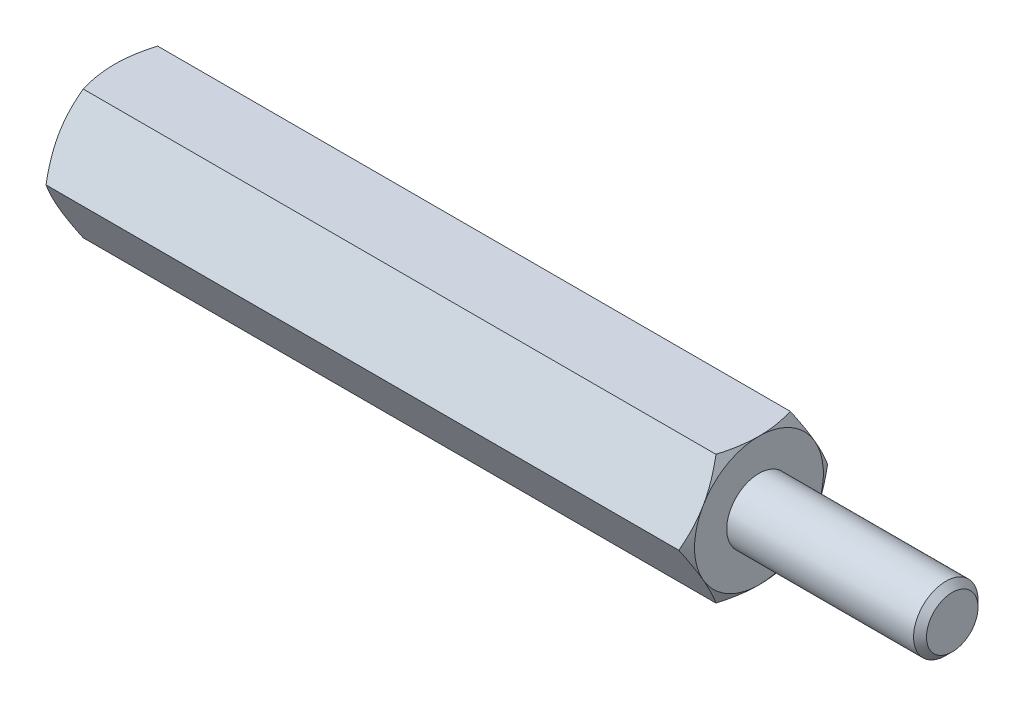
ISO-10303-21;
HEADER;
FILE_DESCRIPTION(('STEP AP214'),'2;1');
FILE_NAME('part.step','',(''),(''),'','','');
FILE_SCHEMA(('AUTOMOTIVE_DESIGN { 1 0 10303 214 1 1 1 1 }'));
ENDSEC;
DATA;
#1=APPLICATION_CONTEXT('core data for automotive mechanical design processes');
#2=APPLICATION_PROTOCOL_DEFINITION('international standard','automotive_design',2000,#1);
#3=PRODUCT_CONTEXT('',#1,'mechanical');
#4=PRODUCT('Part','Part','',(#3));
#5=PRODUCT_RELATED_PRODUCT_CATEGORY('part','',(#4));
#6=PRODUCT_DEFINITION_FORMATION('','',#4);
#7=PRODUCT_DEFINITION_CONTEXT('part definition',#1,'design');
#8=PRODUCT_DEFINITION('design','',#6,#7);
#9=PRODUCT_DEFINITION_SHAPE('','',#8);
#10=(LENGTH_UNIT() NAMED_UNIT(*) SI_UNIT(.MILLI.,.METRE.));
#11=(NAMED_UNIT(*) PLANE_ANGLE_UNIT() SI_UNIT($,.RADIAN.));
#12=(NAMED_UNIT(*) SI_UNIT($,.STERADIAN.) SOLID_ANGLE_UNIT());
#13=UNCERTAINTY_MEASURE_WITH_UNIT(LENGTH_MEASURE(1.E-05),#10,'distance_accuracy_value','');
#14=(GEOMETRIC_REPRESENTATION_CONTEXT(3) GLOBAL_UNCERTAINTY_ASSIGNED_CONTEXT((#13)) GLOBAL_UNIT_ASSIGNED_CONTEXT((#10,
#11,#12)) REPRESENTATION_CONTEXT('',''));
#15=CARTESIAN_POINT('',(0.,0.,0.));
#16=DIRECTION('',(0.,0.,1.));
#17=DIRECTION('',(1.,0.,0.));
#18=AXIS2_PLACEMENT_3D('',#15,#16,#17);
#19=CARTESIAN_POINT('',(10.,2.,-1.15470053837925));
#20=DIRECTION('',(1.,0.,0.));
#21=DIRECTION('',(0.,0.,-1.));
#22=AXIS2_PLACEMENT_3D('',#19,#20,#21);
#23=PLANE('',#22);
#24=CARTESIAN_POINT('',(10.,0.,0.));
#25=DIRECTION('',(1.,0.,0.));
#26=DIRECTION('',(0.,0.,-1.));
#27=AXIS2_PLACEMENT_3D('',#24,#25,#26);
#28=CIRCLE('',#27,2.);
#29=CARTESIAN_POINT('',(10.,-1.,-1.73205080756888));
#30=VERTEX_POINT('',#29);
#31=CARTESIAN_POINT('',(10.,0.999999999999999,-1.73205080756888));
#32=VERTEX_POINT('',#31);
#33=EDGE_CURVE('E288',#30,#32,#28,.T.);
#34=ORIENTED_EDGE('',*,*,#33,.T.);
#35=CARTESIAN_POINT('',(10.,2.,0.));
#36=VERTEX_POINT('',#35);
#37=EDGE_CURVE('E53',#32,#36,#28,.T.);
#38=ORIENTED_EDGE('',*,*,#37,.T.);
#39=CARTESIAN_POINT('',(10.,0.999999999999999,1.73205080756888));
#40=VERTEX_POINT('',#39);
#41=EDGE_CURVE('E295',#36,#40,#28,.T.);
#42=ORIENTED_EDGE('',*,*,#41,.T.);
#43=CARTESIAN_POINT('',(10.,-1.,1.73205080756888));
#44=VERTEX_POINT('',#43);
#45=EDGE_CURVE('E300',#40,#44,#28,.T.);
#46=ORIENTED_EDGE('',*,*,#45,.T.);
#47=CARTESIAN_POINT('',(10.,0.,0.));
#48=DIRECTION('',(-1.,0.,0.));
#49=DIRECTION('',(0.,-1.,0.));
#50=AXIS2_PLACEMENT_3D('',#47,#48,#49);
#51=CIRCLE('',#50,2.);
#52=CARTESIAN_POINT('',(10.,-2.,0.));
#53=VERTEX_POINT('',#52);
#54=EDGE_CURVE('E193',#53,#44,#51,.T.);
#55=ORIENTED_EDGE('',*,*,#54,.F.);
#56=EDGE_CURVE('E61',#53,#30,#28,.T.);
#57=ORIENTED_EDGE('',*,*,#56,.T.);
#58=EDGE_LOOP('',(#34,#38,#42,#46,#55,#57));
#59=FACE_BOUND('',#58,.T.);
#60=CARTESIAN_POINT('',(10.,0.,0.));
#61=DIRECTION('',(1.,0.,0.));
#62=DIRECTION('',(0.,0.,-1.));
#63=AXIS2_PLACEMENT_3D('',#60,#61,#62);
#64=CIRCLE('',#63,1.);
#65=CARTESIAN_POINT('',(10.,0.,-1.));
#66=VERTEX_POINT('',#65);
#67=EDGE_CURVE('E324',#66,#66,#64,.T.);
#68=ORIENTED_EDGE('',*,*,#67,.F.);
#69=EDGE_LOOP('',(#68));
#70=FACE_BOUND('',#69,.T.);
#71=ADVANCED_FACE('F37',(#59,#70),#23,.T.);
#72=CARTESIAN_POINT('',(10.,0.,-2.3094010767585));
#73=DIRECTION('',(0.,-0.5,0.866025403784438));
#74=DIRECTION('',(0.,-0.866025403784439,-0.5));
#75=AXIS2_PLACEMENT_3D('',#72,#73,#74);
#76=PLANE('',#75);
#77=CARTESIAN_POINT('',(9.8213005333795,-0.000200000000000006,-2.30951654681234));
#78=CARTESIAN_POINT('',(9.85061046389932,0.0876912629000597,-2.25877250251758));
#79=CARTESIAN_POINT('',(9.87726714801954,0.176341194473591,-2.20759044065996));
#80=CARTESIAN_POINT('',(9.92379750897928,0.355176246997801,-2.10433997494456));
#81=CARTESIAN_POINT('',(9.94365472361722,0.445364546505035,-2.05226973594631));
#82=CARTESIAN_POINT('',(9.97456653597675,0.624623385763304,-1.94877459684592));
#83=CARTESIAN_POINT('',(9.98582684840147,0.713666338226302,-1.89736562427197));
#84=CARTESIAN_POINT('',(9.99927133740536,0.892171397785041,-1.79430568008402));
#85=CARTESIAN_POINT('',(10.0014666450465,0.981632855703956,-1.74265508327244));
#86=CARTESIAN_POINT('',(9.99690901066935,1.1488083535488,-1.64613626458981));
#87=CARTESIAN_POINT('',(9.99127512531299,1.22654737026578,-1.60125362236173));
#88=CARTESIAN_POINT('',(9.97341610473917,1.38151891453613,-1.51178075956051));
#89=CARTESIAN_POINT('',(9.96118486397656,1.4587509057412,-1.46719084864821));
#90=CARTESIAN_POINT('',(9.93060656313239,1.6140421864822,-1.37753338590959));
#91=CARTESIAN_POINT('',(9.91212983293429,1.69208181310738,-1.33247718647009));
#92=CARTESIAN_POINT('',(9.87019448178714,1.84699686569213,-1.24303693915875));
#93=CARTESIAN_POINT('',(9.84674571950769,1.92387427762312,-1.1986517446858));
#94=CARTESIAN_POINT('',(9.8213005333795,2.0002,-1.15458506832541));
#95=B_SPLINE_CURVE_WITH_KNOTS('',3,(#77,#78,#79,#80,#81,#82,#83,#84,#85,#86,#87,#88,#89,#90,#91,
#92,#93,#94),.UNSPECIFIED.,.F.,.F.,(4,2,2,2,2,2,2,2,4),(0.,0.317031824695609,0.634825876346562,
0.944753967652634,1.25430138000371,1.52387047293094,1.79368946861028,2.06949491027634,
2.34475850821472),.UNSPECIFIED.);
#96=CARTESIAN_POINT('',(9.82136720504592,0.,-2.3094010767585));
#97=VERTEX_POINT('',#96);
#98=EDGE_CURVE('E311',#97,#32,#95,.T.);
#99=ORIENTED_EDGE('',*,*,#98,.F.);
#100=DIRECTION('',(-1.,0.,0.));
#101=VECTOR('',#100,1.);
#102=CARTESIAN_POINT('',(10.,0.,-2.3094010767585));
#103=LINE('',#102,#101);
#104=CARTESIAN_POINT('',(-9.82136720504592,0.,-2.3094010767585));
#105=VERTEX_POINT('',#104);
#106=EDGE_CURVE('E264',#97,#105,#103,.T.);
#107=ORIENTED_EDGE('',*,*,#106,.T.);
#108=CARTESIAN_POINT('',(-9.8213005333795,2.0002,-1.15458506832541));
#109=CARTESIAN_POINT('',(-9.85061046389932,1.91230873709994,-1.20532911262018));
#110=CARTESIAN_POINT('',(-9.87726714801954,1.82365880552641,-1.2565111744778));
#111=CARTESIAN_POINT('',(-9.92379750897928,1.6448237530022,-1.35976164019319));
#112=CARTESIAN_POINT('',(-9.94365472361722,1.55463545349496,-1.41183187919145));
#113=CARTESIAN_POINT('',(-9.97456653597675,1.37537661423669,-1.51532701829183));
#114=CARTESIAN_POINT('',(-9.98582684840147,1.2863336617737,-1.56673599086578));
#115=CARTESIAN_POINT('',(-9.99927133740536,1.10782860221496,-1.66979593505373));
#116=CARTESIAN_POINT('',(-10.0014666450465,1.01836714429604,-1.72144653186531));
#117=CARTESIAN_POINT('',(-9.99690901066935,0.851191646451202,-1.81796535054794));
#118=CARTESIAN_POINT('',(-9.99127512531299,0.773452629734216,-1.86284799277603));
#119=CARTESIAN_POINT('',(-9.97341610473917,0.618481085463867,-1.95232085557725));
#120=CARTESIAN_POINT('',(-9.96118486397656,0.541249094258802,-1.99691076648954));
#121=CARTESIAN_POINT('',(-9.93060656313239,0.385957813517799,-2.08656822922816));
#122=CARTESIAN_POINT('',(-9.91212983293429,0.307918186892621,-2.13162442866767));
#123=CARTESIAN_POINT('',(-9.87019448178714,0.153003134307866,-2.221064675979));
#124=CARTESIAN_POINT('',(-9.84674571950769,0.0761257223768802,-2.26544987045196));
#125=CARTESIAN_POINT('',(-9.8213005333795,-0.000200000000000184,-2.30951654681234));
#126=B_SPLINE_CURVE_WITH_KNOTS('',3,(#108,#109,#110,#111,#112,#113,#114,#115,#116,#117,#118,
#119,#120,#121,#122,#123,#124,#125),.UNSPECIFIED.,.F.,.F.,(4,2,2,2,2,2,2,2,4),(0.,
0.317031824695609,0.634825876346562,0.944753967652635,1.25430138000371,1.52387047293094,
1.79368946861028,2.06949491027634,2.34475850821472),.UNSPECIFIED.);
#127=CARTESIAN_POINT('',(-10.,0.999999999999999,-1.73205080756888));
#128=VERTEX_POINT('',#127);
#129=EDGE_CURVE('E340',#128,#105,#126,.T.);
#130=ORIENTED_EDGE('',*,*,#129,.F.);
#131=CARTESIAN_POINT('',(-9.82136720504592,2.,-1.15470053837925));
#132=VERTEX_POINT('',#131);
#133=EDGE_CURVE('E343',#132,#128,#126,.T.);
#134=ORIENTED_EDGE('',*,*,#133,.F.);
#135=DIRECTION('',(-1.,0.,0.));
#136=VECTOR('',#135,1.);
#137=CARTESIAN_POINT('',(10.,2.,-1.15470053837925));
#138=LINE('',#137,#136);
#139=CARTESIAN_POINT('',(9.821367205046,2.,-1.15470053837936));
#140=VERTEX_POINT('',#139);
#141=EDGE_CURVE('E279',#140,#132,#138,.T.);
#142=ORIENTED_EDGE('',*,*,#141,.F.);
#143=EDGE_CURVE('E229',#32,#140,#95,.T.);
#144=ORIENTED_EDGE('',*,*,#143,.F.);
#145=EDGE_LOOP('',(#99,#107,#130,#134,#142,#144));
#146=FACE_BOUND('',#145,.T.);
#147=ADVANCED_FACE('F148',(#146),#76,.F.);
#148=CARTESIAN_POINT('',(10.,2.,-1.15470053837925));
#149=DIRECTION('',(0.,-1.,0.));
#150=DIRECTION('',(0.,0.,-1.));
#151=AXIS2_PLACEMENT_3D('',#148,#149,#150);
#152=PLANE('',#151);
#153=CARTESIAN_POINT('',(9.0041453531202,2.,-3.14239762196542));
#154=CARTESIAN_POINT('',(9.04685680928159,2.,-3.05468337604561));
#155=CARTESIAN_POINT('',(9.08917030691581,2.,-2.96677207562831));
#156=CARTESIAN_POINT('',(9.17277831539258,2.,-2.79045070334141));
#157=CARTESIAN_POINT('',(9.21407267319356,2.,-2.70204055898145));
#158=CARTESIAN_POINT('',(9.29561838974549,2.,-2.52418069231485));
#159=CARTESIAN_POINT('',(9.33586319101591,2.,-2.43472795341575));
#160=CARTESIAN_POINT('',(9.41475904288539,2.,-2.25512498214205));
#161=CARTESIAN_POINT('',(9.45341016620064,2.,-2.16497478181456));
#162=CARTESIAN_POINT('',(9.52996617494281,2.,-1.98078525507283));
#163=CARTESIAN_POINT('',(9.56780217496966,2.,-1.88671714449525));
#164=CARTESIAN_POINT('',(9.64070044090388,2.,-1.69751412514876));
#165=CARTESIAN_POINT('',(9.67576294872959,2.,-1.60237931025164));
#166=CARTESIAN_POINT('',(9.74223535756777,2.,-1.41102905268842));
#167=CARTESIAN_POINT('',(9.77365196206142,2.,-1.31481596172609));
#168=CARTESIAN_POINT('',(9.83184764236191,2.,-1.12101028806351));
#169=CARTESIAN_POINT('',(9.8586281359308,2.,-1.02341813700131));
#170=CARTESIAN_POINT('',(9.90615162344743,2.,-0.827336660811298));
#171=CARTESIAN_POINT('',(9.9269281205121,2.,-0.728855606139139));
#172=CARTESIAN_POINT('',(9.96129559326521,2.,-0.530628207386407));
#173=CARTESIAN_POINT('',(9.97488733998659,2.,-0.430882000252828));
#174=CARTESIAN_POINT('',(9.99362159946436,2.,-0.231937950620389));
#175=CARTESIAN_POINT('',(9.99887592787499,2.,-0.132750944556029));
#176=CARTESIAN_POINT('',(10.0007996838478,2.,0.0657049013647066));
#177=CARTESIAN_POINT('',(9.9974689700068,2.,0.164973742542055));
#178=CARTESIAN_POINT('',(9.97965125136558,2.,0.400692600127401));
#179=CARTESIAN_POINT('',(9.96138848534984,2.,0.536859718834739));
#180=CARTESIAN_POINT('',(9.91179958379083,2.,0.806792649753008));
#181=CARTESIAN_POINT('',(9.88046153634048,2.,0.9405561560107));
#182=CARTESIAN_POINT('',(9.80733694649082,2.,1.20849227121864));
#183=CARTESIAN_POINT('',(9.76532316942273,2.,1.34260127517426));
#184=CARTESIAN_POINT('',(9.69701155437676,2.,1.54188460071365));
#185=CARTESIAN_POINT('',(9.67336125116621,2.,1.6079939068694));
#186=CARTESIAN_POINT('',(9.62457310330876,2.,1.73966131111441));
#187=CARTESIAN_POINT('',(9.59943529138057,2.,1.80521942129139));
#188=CARTESIAN_POINT('',(9.53045244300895,2.,1.98014362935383));
#189=CARTESIAN_POINT('',(9.48548288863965,2.,2.08906517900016));
#190=CARTESIAN_POINT('',(9.39293953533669,2.,2.3058004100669));
#191=CARTESIAN_POINT('',(9.34536546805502,2.,2.41361397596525));
#192=CARTESIAN_POINT('',(9.24822629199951,2.,2.62838132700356));
#193=CARTESIAN_POINT('',(9.19866051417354,2.,2.7353348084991));
#194=CARTESIAN_POINT('',(9.09800140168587,2.,2.94852186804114));
#195=CARTESIAN_POINT('',(9.04690802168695,2.,3.05475542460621));
#196=CARTESIAN_POINT('',(8.89169615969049,2.,3.37291303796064));
#197=CARTESIAN_POINT('',(8.78579652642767,2.,3.58396705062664));
#198=CARTESIAN_POINT('',(8.57100981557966,2.,4.00448363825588));
#199=CARTESIAN_POINT('',(8.46212334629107,2.,4.21394652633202));
#200=CARTESIAN_POINT('',(8.25376773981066,2.,4.61000648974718));
#201=CARTESIAN_POINT('',(8.15450073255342,2.,4.79671008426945));
#202=CARTESIAN_POINT('',(7.95476413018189,2.,5.16948614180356));
#203=CARTESIAN_POINT('',(7.85429446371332,2.,5.35555856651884));
#204=CARTESIAN_POINT('',(7.6527937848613,2.,5.72660635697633));
#205=CARTESIAN_POINT('',(7.55176570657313,2.,5.91158331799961));
#206=CARTESIAN_POINT('',(7.34902395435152,2.,6.28114276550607));
#207=CARTESIAN_POINT('',(7.24731033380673,2.,6.46572528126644));
#208=CARTESIAN_POINT('',(7.14534707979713,2.,6.65016883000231));
#209=B_SPLINE_CURVE_WITH_KNOTS('',3,(#153,#154,#155,#156,#157,#158,#159,#160,#161,#162,#163,
#164,#165,#166,#167,#168,#169,#170,#171,#172,#173,#174,#175,#176,#177,#178,#179,#180,#181,#182,
#183,#184,#185,#186,#187,#188,#189,#190,#191,#192,#193,#194,#195,#196,#197,#198,#199,#200,#201,
#202,#203,#204,#205,#206,#207,#208),.UNSPECIFIED.,.F.,.F.,(4,2,2,2,2,2,2,2,2,2,2,2,2,2,2,2,2,2,
2,2,2,2,2,2,2,2,2,4),(0.,0.29268498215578,0.585413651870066,0.879667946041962,1.17390879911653,
1.47805164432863,1.78216793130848,2.08571589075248,2.38917085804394,2.690898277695,
2.99259331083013,3.29020694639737,3.58782548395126,3.99913738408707,4.41082482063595,
4.83214112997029,5.0427662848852,5.25338680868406,5.6068563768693,5.96036243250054,
6.31398824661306,6.66762456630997,7.37597688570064,8.08418599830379,8.71853756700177,
9.3529269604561,9.98522933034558,10.6174830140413),.UNSPECIFIED.);
#210=EDGE_CURVE('E227',#140,#36,#209,.T.);
#211=ORIENTED_EDGE('',*,*,#210,.F.);
#212=ORIENTED_EDGE('',*,*,#141,.T.);
#213=CARTESIAN_POINT('',(-9.0041453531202,2.,-3.14239762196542));
#214=CARTESIAN_POINT('',(-9.0468568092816,2.,-3.05468337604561));
#215=CARTESIAN_POINT('',(-9.08917030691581,2.,-2.96677207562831));
#216=CARTESIAN_POINT('',(-9.17277831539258,2.,-2.79045070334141));
#217=CARTESIAN_POINT('',(-9.21407267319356,2.,-2.70204055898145));
#218=CARTESIAN_POINT('',(-9.29561838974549,2.,-2.52418069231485));
#219=CARTESIAN_POINT('',(-9.33586319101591,2.,-2.43472795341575));
#220=CARTESIAN_POINT('',(-9.41475904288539,2.,-2.25512498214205));
#221=CARTESIAN_POINT('',(-9.45341016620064,2.,-2.16497478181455));
#222=CARTESIAN_POINT('',(-9.52996617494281,2.,-1.98078525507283));
#223=CARTESIAN_POINT('',(-9.56780217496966,2.,-1.88671714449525));
#224=CARTESIAN_POINT('',(-9.64070044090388,2.,-1.69751412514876));
#225=CARTESIAN_POINT('',(-9.67576294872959,2.,-1.60237931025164));
#226=CARTESIAN_POINT('',(-9.74223535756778,2.,-1.41102905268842));
#227=CARTESIAN_POINT('',(-9.77365196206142,2.,-1.31481596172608));
#228=CARTESIAN_POINT('',(-9.83184764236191,2.,-1.12101028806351));
#229=CARTESIAN_POINT('',(-9.8586281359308,2.,-1.02341813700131));
#230=CARTESIAN_POINT('',(-9.90615162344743,2.,-0.827336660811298));
#231=CARTESIAN_POINT('',(-9.9269281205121,2.,-0.728855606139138));
#232=CARTESIAN_POINT('',(-9.96129559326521,2.,-0.530628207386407));
#233=CARTESIAN_POINT('',(-9.97488733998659,2.,-0.430882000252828));
#234=CARTESIAN_POINT('',(-9.99362159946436,2.,-0.231937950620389));
#235=CARTESIAN_POINT('',(-9.99887592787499,2.,-0.132750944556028));
#236=CARTESIAN_POINT('',(-10.0007996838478,2.,0.065704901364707));
#237=CARTESIAN_POINT('',(-9.9974689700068,2.,0.164973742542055));
#238=CARTESIAN_POINT('',(-9.97965125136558,2.,0.400692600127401));
#239=CARTESIAN_POINT('',(-9.96138848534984,2.,0.536859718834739));
#240=CARTESIAN_POINT('',(-9.91179958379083,2.,0.806792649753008));
#241=CARTESIAN_POINT('',(-9.88046153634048,2.,0.9405561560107));
#242=CARTESIAN_POINT('',(-9.80733694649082,2.,1.20849227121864));
#243=CARTESIAN_POINT('',(-9.76532316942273,2.,1.34260127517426));
#244=CARTESIAN_POINT('',(-9.69701155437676,2.,1.54188460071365));
#245=CARTESIAN_POINT('',(-9.67336125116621,2.,1.60799390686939));
#246=CARTESIAN_POINT('',(-9.62457310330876,2.,1.73966131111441));
#247=CARTESIAN_POINT('',(-9.59943529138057,2.,1.80521942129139));
#248=CARTESIAN_POINT('',(-9.53045244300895,2.,1.98014362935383));
#249=CARTESIAN_POINT('',(-9.48548288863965,2.,2.08906517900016));
#250=CARTESIAN_POINT('',(-9.39293953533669,2.,2.3058004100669));
#251=CARTESIAN_POINT('',(-9.34536546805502,2.,2.41361397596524));
#252=CARTESIAN_POINT('',(-9.24822629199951,2.,2.62838132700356));
#253=CARTESIAN_POINT('',(-9.19866051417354,2.,2.7353348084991));
#254=CARTESIAN_POINT('',(-9.09800140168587,2.,2.94852186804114));
#255=CARTESIAN_POINT('',(-9.04690802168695,2.,3.05475542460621));
#256=CARTESIAN_POINT('',(-8.89169615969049,2.,3.37291303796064));
#257=CARTESIAN_POINT('',(-8.78579652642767,2.,3.58396705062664));
#258=CARTESIAN_POINT('',(-8.57100981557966,2.,4.00448363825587));
#259=CARTESIAN_POINT('',(-8.46212334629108,2.,4.21394652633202));
#260=CARTESIAN_POINT('',(-8.25376773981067,2.,4.61000648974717));
#261=CARTESIAN_POINT('',(-8.15450073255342,2.,4.79671008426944));
#262=CARTESIAN_POINT('',(-7.9547641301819,2.,5.16948614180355));
#263=CARTESIAN_POINT('',(-7.85429446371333,2.,5.35555856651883));
#264=CARTESIAN_POINT('',(-7.6527937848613,2.,5.72660635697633));
#265=CARTESIAN_POINT('',(-7.55176570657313,2.,5.9115833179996));
#266=CARTESIAN_POINT('',(-7.34902395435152,2.,6.28114276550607));
#267=CARTESIAN_POINT('',(-7.24731033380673,2.,6.46572528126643));
#268=CARTESIAN_POINT('',(-7.14534707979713,2.,6.65016883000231));
#269=B_SPLINE_CURVE_WITH_KNOTS('',3,(#213,#214,#215,#216,#217,#218,#219,#220,#221,#222,#223,
#224,#225,#226,#227,#228,#229,#230,#231,#232,#233,#234,#235,#236,#237,#238,#239,#240,#241,#242,
#243,#244,#245,#246,#247,#248,#249,#250,#251,#252,#253,#254,#255,#256,#257,#258,#259,#260,#261,
#262,#263,#264,#265,#266,#267,#268),.UNSPECIFIED.,.F.,.F.,(4,2,2,2,2,2,2,2,2,2,2,2,2,2,2,2,2,2,
2,2,2,2,2,2,2,2,2,4),(0.,0.292684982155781,0.585413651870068,0.879667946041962,1.17390879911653,
1.47805164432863,1.78216793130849,2.08571589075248,2.38917085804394,2.690898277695,
2.99259331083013,3.29020694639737,3.58782548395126,3.99913738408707,4.41082482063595,
4.83214112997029,5.0427662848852,5.25338680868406,5.60685637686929,5.96036243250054,
6.31398824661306,6.66762456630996,7.37597688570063,8.08418599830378,8.71853756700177,
9.35292696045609,9.98522933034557,10.6174830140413),.UNSPECIFIED.);
#270=CARTESIAN_POINT('',(-10.,2.,0.));
#271=VERTEX_POINT('',#270);
#272=EDGE_CURVE('E241',#271,#132,#269,.F.);
#273=ORIENTED_EDGE('',*,*,#272,.F.);
#274=CARTESIAN_POINT('',(-9.82136720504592,2.,1.15470053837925));
#275=VERTEX_POINT('',#274);
#276=EDGE_CURVE('E249',#275,#271,#269,.F.);
#277=ORIENTED_EDGE('',*,*,#276,.F.);
#278=DIRECTION('',(-1.,0.,0.));
#279=VECTOR('',#278,1.);
#280=CARTESIAN_POINT('',(10.,2.,1.15470053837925));
#281=LINE('',#280,#279);
#282=CARTESIAN_POINT('',(9.82136720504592,2.,1.15470053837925));
#283=VERTEX_POINT('',#282);
#284=EDGE_CURVE('E276',#283,#275,#281,.T.);
#285=ORIENTED_EDGE('',*,*,#284,.F.);
#286=EDGE_CURVE('E221',#36,#283,#209,.T.);
#287=ORIENTED_EDGE('',*,*,#286,.F.);
#288=EDGE_LOOP('',(#211,#212,#273,#277,#285,#287));
#289=FACE_BOUND('',#288,.T.);
#290=ADVANCED_FACE('F153',(#289),#152,.F.);
#291=CARTESIAN_POINT('',(10.,2.,1.15470053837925));
#292=DIRECTION('',(0.,-0.5,-0.866025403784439));
#293=DIRECTION('',(0.,0.866025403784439,-0.5));
#294=AXIS2_PLACEMENT_3D('',#291,#292,#293);
#295=PLANE('',#294);
#296=CARTESIAN_POINT('',(9.8213005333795,2.0002,1.15458506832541));
#297=CARTESIAN_POINT('',(9.85061046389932,1.91230873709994,1.20532911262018));
#298=CARTESIAN_POINT('',(9.87726714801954,1.82365880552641,1.2565111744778));
#299=CARTESIAN_POINT('',(9.92379750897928,1.6448237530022,1.35976164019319));
#300=CARTESIAN_POINT('',(9.94365472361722,1.55463545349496,1.41183187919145));
#301=CARTESIAN_POINT('',(9.97456653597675,1.37537661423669,1.51532701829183));
#302=CARTESIAN_POINT('',(9.98582684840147,1.2863336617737,1.56673599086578));
#303=CARTESIAN_POINT('',(9.99927133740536,1.10782860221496,1.66979593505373));
#304=CARTESIAN_POINT('',(10.0014666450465,1.01836714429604,1.72144653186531));
#305=CARTESIAN_POINT('',(9.99690901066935,0.851191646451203,1.81796535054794));
#306=CARTESIAN_POINT('',(9.99127512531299,0.773452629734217,1.86284799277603));
#307=CARTESIAN_POINT('',(9.97341610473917,0.618481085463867,1.95232085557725));
#308=CARTESIAN_POINT('',(9.96118486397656,0.541249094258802,1.99691076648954));
#309=CARTESIAN_POINT('',(9.93060656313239,0.385957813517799,2.08656822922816));
#310=CARTESIAN_POINT('',(9.91212983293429,0.307918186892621,2.13162442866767));
#311=CARTESIAN_POINT('',(9.87019448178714,0.153003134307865,2.221064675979));
#312=CARTESIAN_POINT('',(9.84674571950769,0.0761257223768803,2.26544987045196));
#313=CARTESIAN_POINT('',(9.8213005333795,-0.000199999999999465,2.30951654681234));
#314=B_SPLINE_CURVE_WITH_KNOTS('',3,(#296,#297,#298,#299,#300,#301,#302,#303,#304,#305,#306,
#307,#308,#309,#310,#311,#312,#313),.UNSPECIFIED.,.F.,.F.,(4,2,2,2,2,2,2,2,4),(0.,
0.317031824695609,0.634825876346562,0.944753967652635,1.25430138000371,1.52387047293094,
1.79368946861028,2.06949491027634,2.34475850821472),.UNSPECIFIED.);
#315=EDGE_CURVE('E228',#283,#40,#314,.T.);
#316=ORIENTED_EDGE('',*,*,#315,.F.);
#317=ORIENTED_EDGE('',*,*,#284,.T.);
#318=CARTESIAN_POINT('',(-9.8213005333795,-0.000199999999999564,2.30951654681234));
#319=CARTESIAN_POINT('',(-9.85061046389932,0.0876912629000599,2.25877250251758));
#320=CARTESIAN_POINT('',(-9.87726714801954,0.176341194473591,2.20759044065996));
#321=CARTESIAN_POINT('',(-9.92379750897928,0.355176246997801,2.10433997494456));
#322=CARTESIAN_POINT('',(-9.94365472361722,0.445364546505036,2.0522697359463));
#323=CARTESIAN_POINT('',(-9.97456653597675,0.624623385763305,1.94877459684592));
#324=CARTESIAN_POINT('',(-9.98582684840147,0.713666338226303,1.89736562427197));
#325=CARTESIAN_POINT('',(-9.99927133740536,0.892171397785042,1.79430568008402));
#326=CARTESIAN_POINT('',(-10.0014666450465,0.981632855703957,1.74265508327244));
#327=CARTESIAN_POINT('',(-9.99690901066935,1.1488083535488,1.64613626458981));
#328=CARTESIAN_POINT('',(-9.99127512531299,1.22654737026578,1.60125362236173));
#329=CARTESIAN_POINT('',(-9.97341610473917,1.38151891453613,1.51178075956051));
#330=CARTESIAN_POINT('',(-9.96118486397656,1.4587509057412,1.46719084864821));
#331=CARTESIAN_POINT('',(-9.93060656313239,1.6140421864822,1.37753338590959));
#332=CARTESIAN_POINT('',(-9.91212983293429,1.69208181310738,1.33247718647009));
#333=CARTESIAN_POINT('',(-9.87019448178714,1.84699686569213,1.24303693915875));
#334=CARTESIAN_POINT('',(-9.84674571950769,1.92387427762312,1.1986517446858));
#335=CARTESIAN_POINT('',(-9.8213005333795,2.0002,1.15458506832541));
#336=B_SPLINE_CURVE_WITH_KNOTS('',3,(#318,#319,#320,#321,#322,#323,#324,#325,#326,#327,#328,
#329,#330,#331,#332,#333,#334,#335),.UNSPECIFIED.,.F.,.F.,(4,2,2,2,2,2,2,2,4),(0.,
0.317031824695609,0.634825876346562,0.944753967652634,1.25430138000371,1.52387047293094,
1.79368946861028,2.06949491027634,2.34475850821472),.UNSPECIFIED.);
#337=CARTESIAN_POINT('',(-10.,0.999999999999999,1.73205080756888));
#338=VERTEX_POINT('',#337);
#339=EDGE_CURVE('E255',#338,#275,#336,.T.);
#340=ORIENTED_EDGE('',*,*,#339,.F.);
#341=CARTESIAN_POINT('',(-9.82136720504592,0.,2.3094010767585));
#342=VERTEX_POINT('',#341);
#343=EDGE_CURVE('E262',#342,#338,#336,.T.);
#344=ORIENTED_EDGE('',*,*,#343,.F.);
#345=DIRECTION('',(-1.,0.,0.));
#346=VECTOR('',#345,1.);
#347=CARTESIAN_POINT('',(10.,0.,2.3094010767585));
#348=LINE('',#347,#346);
#349=CARTESIAN_POINT('',(9.82136720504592,0.,2.3094010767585));
#350=VERTEX_POINT('',#349);
#351=EDGE_CURVE('E273',#350,#342,#348,.T.);
#352=ORIENTED_EDGE('',*,*,#351,.F.);
#353=EDGE_CURVE('E215',#40,#350,#314,.T.);
#354=ORIENTED_EDGE('',*,*,#353,.F.);
#355=EDGE_LOOP('',(#316,#317,#340,#344,#352,#354));
#356=FACE_BOUND('',#355,.T.);
#357=ADVANCED_FACE('F235',(#356),#295,.F.);
#358=CARTESIAN_POINT('',(10.,0.,2.3094010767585));
#359=DIRECTION('',(0.,0.5,-0.866025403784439));
#360=DIRECTION('',(0.,0.866025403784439,0.5));
#361=AXIS2_PLACEMENT_3D('',#358,#359,#360);
#362=PLANE('',#361);
#363=CARTESIAN_POINT('',(9.8213005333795,0.000200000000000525,2.30951654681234));
#364=CARTESIAN_POINT('',(9.85061046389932,-0.0876912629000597,2.25877250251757));
#365=CARTESIAN_POINT('',(9.87726714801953,-0.176341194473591,2.20759044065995));
#366=CARTESIAN_POINT('',(9.92379750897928,-0.355176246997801,2.10433997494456));
#367=CARTESIAN_POINT('',(9.94365472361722,-0.445364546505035,2.0522697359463));
#368=CARTESIAN_POINT('',(9.97456653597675,-0.624623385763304,1.94877459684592));
#369=CARTESIAN_POINT('',(9.98582684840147,-0.713666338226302,1.89736562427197));
#370=CARTESIAN_POINT('',(9.99927133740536,-0.892171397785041,1.79430568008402));
#371=CARTESIAN_POINT('',(10.0014666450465,-0.981632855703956,1.74265508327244));
#372=CARTESIAN_POINT('',(9.99690901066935,-1.1488083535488,1.64613626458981));
#373=CARTESIAN_POINT('',(9.99127512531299,-1.22654737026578,1.60125362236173));
#374=CARTESIAN_POINT('',(9.97341610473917,-1.38151891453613,1.51178075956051));
#375=CARTESIAN_POINT('',(9.96118486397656,-1.4587509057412,1.46719084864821));
#376=CARTESIAN_POINT('',(9.93060656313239,-1.6140421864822,1.37753338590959));
#377=CARTESIAN_POINT('',(9.91212983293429,-1.69208181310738,1.33247718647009));
#378=CARTESIAN_POINT('',(9.87019448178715,-1.84699686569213,1.24303693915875));
#379=CARTESIAN_POINT('',(9.84674571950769,-1.92387427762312,1.1986517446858));
#380=CARTESIAN_POINT('',(9.8213005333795,-2.0002,1.15458506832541));
#381=B_SPLINE_CURVE_WITH_KNOTS('',3,(#363,#364,#365,#366,#367,#368,#369,#370,#371,#372,#373,
#374,#375,#376,#377,#378,#379,#380),.UNSPECIFIED.,.F.,.F.,(4,2,2,2,2,2,2,2,4),(0.,
0.31703182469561,0.634825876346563,0.944753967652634,1.25430138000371,1.52387047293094,
1.79368946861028,2.06949491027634,2.34475850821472),.UNSPECIFIED.);
#382=EDGE_CURVE('E389',#350,#44,#381,.T.);
#383=ORIENTED_EDGE('',*,*,#382,.F.);
#384=ORIENTED_EDGE('',*,*,#351,.T.);
#385=CARTESIAN_POINT('',(-9.8213005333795,-2.0002,1.15458506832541));
#386=CARTESIAN_POINT('',(-9.85061046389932,-1.91230873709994,1.20532911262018));
#387=CARTESIAN_POINT('',(-9.87726714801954,-1.82365880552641,1.2565111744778));
#388=CARTESIAN_POINT('',(-9.92379750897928,-1.6448237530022,1.35976164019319));
#389=CARTESIAN_POINT('',(-9.94365472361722,-1.55463545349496,1.41183187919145));
#390=CARTESIAN_POINT('',(-9.97456653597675,-1.3753766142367,1.51532701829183));
#391=CARTESIAN_POINT('',(-9.98582684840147,-1.2863336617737,1.56673599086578));
#392=CARTESIAN_POINT('',(-9.99927133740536,-1.10782860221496,1.66979593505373));
#393=CARTESIAN_POINT('',(-10.0014666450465,-1.01836714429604,1.72144653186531));
#394=CARTESIAN_POINT('',(-9.99690901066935,-0.851191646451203,1.81796535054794));
#395=CARTESIAN_POINT('',(-9.99127512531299,-0.773452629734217,1.86284799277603));
#396=CARTESIAN_POINT('',(-9.97341610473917,-0.618481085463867,1.95232085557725));
#397=CARTESIAN_POINT('',(-9.96118486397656,-0.541249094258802,1.99691076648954));
#398=CARTESIAN_POINT('',(-9.93060656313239,-0.3859578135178,2.08656822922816));
#399=CARTESIAN_POINT('',(-9.91212983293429,-0.307918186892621,2.13162442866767));
#400=CARTESIAN_POINT('',(-9.87019448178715,-0.153003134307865,2.221064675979));
#401=CARTESIAN_POINT('',(-9.84674571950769,-0.0761257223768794,2.26544987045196));
#402=CARTESIAN_POINT('',(-9.8213005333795,0.000200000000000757,2.30951654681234));
#403=B_SPLINE_CURVE_WITH_KNOTS('',3,(#385,#386,#387,#388,#389,#390,#391,#392,#393,#394,#395,
#396,#397,#398,#399,#400,#401,#402),.UNSPECIFIED.,.F.,.F.,(4,2,2,2,2,2,2,2,4),(0.,
0.317031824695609,0.634825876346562,0.944753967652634,1.25430138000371,1.52387047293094,
1.79368946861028,2.06949491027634,2.34475850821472),.UNSPECIFIED.);
#404=CARTESIAN_POINT('',(-10.,-1.,1.73205080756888));
#405=VERTEX_POINT('',#404);
#406=EDGE_CURVE('E263',#405,#342,#403,.T.);
#407=ORIENTED_EDGE('',*,*,#406,.F.);
#408=CARTESIAN_POINT('',(-9.82136720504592,-2.,1.15470053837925));
#409=VERTEX_POINT('',#408);
#410=EDGE_CURVE('E250',#409,#405,#403,.T.);
#411=ORIENTED_EDGE('',*,*,#410,.F.);
#412=DIRECTION('',(-1.,0.,0.));
#413=VECTOR('',#412,1.);
#414=CARTESIAN_POINT('',(10.,-2.,1.15470053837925));
#415=LINE('',#414,#413);
#416=CARTESIAN_POINT('',(9.82136720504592,-2.,1.15470053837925));
#417=VERTEX_POINT('',#416);
#418=EDGE_CURVE('E270',#417,#409,#415,.T.);
#419=ORIENTED_EDGE('',*,*,#418,.F.);
#420=EDGE_CURVE('E210',#44,#417,#381,.T.);
#421=ORIENTED_EDGE('',*,*,#420,.F.);
#422=EDGE_LOOP('',(#383,#384,#407,#411,#419,#421));
#423=FACE_BOUND('',#422,.T.);
#424=ADVANCED_FACE('F387',(#423),#362,.F.);
#425=CARTESIAN_POINT('',(10.,-2.,1.15470053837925));
#426=DIRECTION('',(0.,1.,0.));
#427=DIRECTION('',(0.,0.,1.));
#428=AXIS2_PLACEMENT_3D('',#425,#426,#427);
#429=PLANE('',#428);
#430=CARTESIAN_POINT('',(9.0041453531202,-2.,-3.14239762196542));
#431=CARTESIAN_POINT('',(9.0468568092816,-2.,-3.05468337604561));
#432=CARTESIAN_POINT('',(9.08917030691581,-2.,-2.96677207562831));
#433=CARTESIAN_POINT('',(9.17277831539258,-2.,-2.79045070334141));
#434=CARTESIAN_POINT('',(9.21407267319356,-2.,-2.70204055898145));
#435=CARTESIAN_POINT('',(9.29561838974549,-2.,-2.52418069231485));
#436=CARTESIAN_POINT('',(9.33586319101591,-2.,-2.43472795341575));
#437=CARTESIAN_POINT('',(9.41475904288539,-2.,-2.25512498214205));
#438=CARTESIAN_POINT('',(9.45341016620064,-2.,-2.16497478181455));
#439=CARTESIAN_POINT('',(9.52996617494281,-2.,-1.98078525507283));
#440=CARTESIAN_POINT('',(9.56780217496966,-2.,-1.88671714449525));
#441=CARTESIAN_POINT('',(9.64070044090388,-2.,-1.69751412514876));
#442=CARTESIAN_POINT('',(9.67576294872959,-2.,-1.60237931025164));
#443=CARTESIAN_POINT('',(9.74223535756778,-2.,-1.41102905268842));
#444=CARTESIAN_POINT('',(9.77365196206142,-2.,-1.31481596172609));
#445=CARTESIAN_POINT('',(9.83184764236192,-2.,-1.12101028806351));
#446=CARTESIAN_POINT('',(9.8586281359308,-2.,-1.02341813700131));
#447=CARTESIAN_POINT('',(9.90615162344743,-2.,-0.827336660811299));
#448=CARTESIAN_POINT('',(9.9269281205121,-2.,-0.728855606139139));
#449=CARTESIAN_POINT('',(9.96129559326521,-2.,-0.530628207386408));
#450=CARTESIAN_POINT('',(9.97488733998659,-2.,-0.430882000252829));
#451=CARTESIAN_POINT('',(9.99362159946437,-2.,-0.23193795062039));
#452=CARTESIAN_POINT('',(9.99887592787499,-2.,-0.13275094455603));
#453=CARTESIAN_POINT('',(10.0007996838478,-2.,0.0657049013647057));
#454=CARTESIAN_POINT('',(9.9974689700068,-2.,0.164973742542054));
#455=CARTESIAN_POINT('',(9.97965125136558,-2.,0.400692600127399));
#456=CARTESIAN_POINT('',(9.96138848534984,-2.,0.536859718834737));
#457=CARTESIAN_POINT('',(9.91179958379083,-2.,0.806792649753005));
#458=CARTESIAN_POINT('',(9.88046153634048,-2.,0.940556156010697));
#459=CARTESIAN_POINT('',(9.80733694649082,-2.,1.20849227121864));
#460=CARTESIAN_POINT('',(9.76532316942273,-2.,1.34260127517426));
#461=CARTESIAN_POINT('',(9.69701155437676,-2.,1.54188460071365));
#462=CARTESIAN_POINT('',(9.67336125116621,-2.,1.60799390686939));
#463=CARTESIAN_POINT('',(9.62457310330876,-2.,1.7396613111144));
#464=CARTESIAN_POINT('',(9.59943529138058,-2.,1.80521942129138));
#465=CARTESIAN_POINT('',(9.53045244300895,-2.,1.98014362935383));
#466=CARTESIAN_POINT('',(9.48548288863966,-2.,2.08906517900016));
#467=CARTESIAN_POINT('',(9.3929395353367,-2.,2.30580041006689));
#468=CARTESIAN_POINT('',(9.34536546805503,-2.,2.41361397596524));
#469=CARTESIAN_POINT('',(9.24822629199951,-2.,2.62838132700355));
#470=CARTESIAN_POINT('',(9.19866051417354,-2.,2.7353348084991));
#471=CARTESIAN_POINT('',(9.09800140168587,-2.,2.94852186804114));
#472=CARTESIAN_POINT('',(9.04690802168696,-2.,3.05475542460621));
#473=CARTESIAN_POINT('',(8.89169615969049,-2.,3.37291303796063));
#474=CARTESIAN_POINT('',(8.78579652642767,-2.,3.58396705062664));
#475=CARTESIAN_POINT('',(8.57100981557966,-2.,4.00448363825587));
#476=CARTESIAN_POINT('',(8.46212334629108,-2.,4.21394652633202));
#477=CARTESIAN_POINT('',(8.25376773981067,-2.,4.61000648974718));
#478=CARTESIAN_POINT('',(8.15450073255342,-2.,4.79671008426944));
#479=CARTESIAN_POINT('',(7.9547641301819,-2.,5.16948614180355));
#480=CARTESIAN_POINT('',(7.85429446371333,-2.,5.35555856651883));
#481=CARTESIAN_POINT('',(7.6527937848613,-2.,5.72660635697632));
#482=CARTESIAN_POINT('',(7.55176570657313,-2.,5.9115833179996));
#483=CARTESIAN_POINT('',(7.34902395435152,-2.,6.28114276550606));
#484=CARTESIAN_POINT('',(7.24731033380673,-2.,6.46572528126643));
#485=CARTESIAN_POINT('',(7.14534707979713,-2.,6.6501688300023));
#486=B_SPLINE_CURVE_WITH_KNOTS('',3,(#430,#431,#432,#433,#434,#435,#436,#437,#438,#439,#440,
#441,#442,#443,#444,#445,#446,#447,#448,#449,#450,#451,#452,#453,#454,#455,#456,#457,#458,#459,
#460,#461,#462,#463,#464,#465,#466,#467,#468,#469,#470,#471,#472,#473,#474,#475,#476,#477,#478,
#479,#480,#481,#482,#483,#484,#485),.UNSPECIFIED.,.F.,.F.,(4,2,2,2,2,2,2,2,2,2,2,2,2,2,2,2,2,2,
2,2,2,2,2,2,2,2,2,4),(0.,0.292684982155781,0.585413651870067,0.879667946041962,1.17390879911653,
1.47805164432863,1.78216793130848,2.08571589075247,2.38917085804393,2.690898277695,
2.99259331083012,3.29020694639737,3.58782548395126,3.99913738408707,4.41082482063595,
4.83214112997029,5.04276628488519,5.25338680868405,5.60685637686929,5.96036243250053,
6.31398824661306,6.66762456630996,7.37597688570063,8.08418599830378,8.71853756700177,
9.35292696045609,9.98522933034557,10.6174830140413),.UNSPECIFIED.);
#487=EDGE_CURVE('E345',#417,#53,#486,.F.);
#488=ORIENTED_EDGE('',*,*,#487,.F.);
#489=ORIENTED_EDGE('',*,*,#418,.T.);
#490=CARTESIAN_POINT('',(-9.0041453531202,-2.,-3.14239762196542));
#491=CARTESIAN_POINT('',(-9.0468568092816,-2.,-3.05468337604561));
#492=CARTESIAN_POINT('',(-9.08917030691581,-2.,-2.96677207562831));
#493=CARTESIAN_POINT('',(-9.17277831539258,-2.,-2.79045070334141));
#494=CARTESIAN_POINT('',(-9.21407267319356,-2.,-2.70204055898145));
#495=CARTESIAN_POINT('',(-9.29561838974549,-2.,-2.52418069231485));
#496=CARTESIAN_POINT('',(-9.33586319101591,-2.,-2.43472795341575));
#497=CARTESIAN_POINT('',(-9.41475904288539,-2.,-2.25512498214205));
#498=CARTESIAN_POINT('',(-9.45341016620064,-2.,-2.16497478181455));
#499=CARTESIAN_POINT('',(-9.52996617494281,-2.,-1.98078525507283));
#500=CARTESIAN_POINT('',(-9.56780217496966,-2.,-1.88671714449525));
#501=CARTESIAN_POINT('',(-9.64070044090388,-2.,-1.69751412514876));
#502=CARTESIAN_POINT('',(-9.67576294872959,-2.,-1.60237931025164));
#503=CARTESIAN_POINT('',(-9.74223535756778,-2.,-1.41102905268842));
#504=CARTESIAN_POINT('',(-9.77365196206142,-2.,-1.31481596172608));
#505=CARTESIAN_POINT('',(-9.83184764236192,-2.,-1.12101028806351));
#506=CARTESIAN_POINT('',(-9.8586281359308,-2.,-1.02341813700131));
#507=CARTESIAN_POINT('',(-9.90615162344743,-2.,-0.827336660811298));
#508=CARTESIAN_POINT('',(-9.9269281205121,-2.,-0.728855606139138));
#509=CARTESIAN_POINT('',(-9.96129559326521,-2.,-0.530628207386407));
#510=CARTESIAN_POINT('',(-9.97488733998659,-2.,-0.430882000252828));
#511=CARTESIAN_POINT('',(-9.99362159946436,-2.,-0.231937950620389));
#512=CARTESIAN_POINT('',(-9.99887592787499,-2.,-0.132750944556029));
#513=CARTESIAN_POINT('',(-10.0007996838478,-2.,0.0657049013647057));
#514=CARTESIAN_POINT('',(-9.9974689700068,-2.,0.164973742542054));
#515=CARTESIAN_POINT('',(-9.97965125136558,-2.,0.400692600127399));
#516=CARTESIAN_POINT('',(-9.96138848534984,-2.,0.536859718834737));
#517=CARTESIAN_POINT('',(-9.91179958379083,-2.,0.806792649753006));
#518=CARTESIAN_POINT('',(-9.88046153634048,-2.,0.940556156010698));
#519=CARTESIAN_POINT('',(-9.80733694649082,-2.,1.20849227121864));
#520=CARTESIAN_POINT('',(-9.76532316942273,-2.,1.34260127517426));
#521=CARTESIAN_POINT('',(-9.69701155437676,-2.,1.54188460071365));
#522=CARTESIAN_POINT('',(-9.67336125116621,-2.,1.60799390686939));
#523=CARTESIAN_POINT('',(-9.62457310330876,-2.,1.7396613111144));
#524=CARTESIAN_POINT('',(-9.59943529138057,-2.,1.80521942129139));
#525=CARTESIAN_POINT('',(-9.53045244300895,-2.,1.98014362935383));
#526=CARTESIAN_POINT('',(-9.48548288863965,-2.,2.08906517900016));
#527=CARTESIAN_POINT('',(-9.3929395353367,-2.,2.3058004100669));
#528=CARTESIAN_POINT('',(-9.34536546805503,-2.,2.41361397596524));
#529=CARTESIAN_POINT('',(-9.24822629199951,-2.,2.62838132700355));
#530=CARTESIAN_POINT('',(-9.19866051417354,-2.,2.7353348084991));
#531=CARTESIAN_POINT('',(-9.09800140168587,-2.,2.94852186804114));
#532=CARTESIAN_POINT('',(-9.04690802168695,-2.,3.05475542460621));
#533=CARTESIAN_POINT('',(-8.89169615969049,-2.,3.37291303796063));
#534=CARTESIAN_POINT('',(-8.78579652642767,-2.,3.58396705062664));
#535=CARTESIAN_POINT('',(-8.57100981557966,-2.,4.00448363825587));
#536=CARTESIAN_POINT('',(-8.46212334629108,-2.,4.21394652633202));
#537=CARTESIAN_POINT('',(-8.25376773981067,-2.,4.61000648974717));
#538=CARTESIAN_POINT('',(-8.15450073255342,-2.,4.79671008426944));
#539=CARTESIAN_POINT('',(-7.9547641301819,-2.,5.16948614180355));
#540=CARTESIAN_POINT('',(-7.85429446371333,-2.,5.35555856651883));
#541=CARTESIAN_POINT('',(-7.6527937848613,-2.,5.72660635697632));
#542=CARTESIAN_POINT('',(-7.55176570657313,-2.,5.9115833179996));
#543=CARTESIAN_POINT('',(-7.34902395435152,-2.,6.28114276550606));
#544=CARTESIAN_POINT('',(-7.24731033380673,-2.,6.46572528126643));
#545=CARTESIAN_POINT('',(-7.14534707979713,-2.,6.6501688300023));
#546=B_SPLINE_CURVE_WITH_KNOTS('',3,(#490,#491,#492,#493,#494,#495,#496,#497,#498,#499,#500,
#501,#502,#503,#504,#505,#506,#507,#508,#509,#510,#511,#512,#513,#514,#515,#516,#517,#518,#519,
#520,#521,#522,#523,#524,#525,#526,#527,#528,#529,#530,#531,#532,#533,#534,#535,#536,#537,#538,
#539,#540,#541,#542,#543,#544,#545),.UNSPECIFIED.,.F.,.F.,(4,2,2,2,2,2,2,2,2,2,2,2,2,2,2,2,2,2,
2,2,2,2,2,2,2,2,2,4),(0.,0.29268498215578,0.585413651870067,0.879667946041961,1.17390879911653,
1.47805164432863,1.78216793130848,2.08571589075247,2.38917085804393,2.690898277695,
2.99259331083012,3.29020694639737,3.58782548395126,3.99913738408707,4.41082482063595,
4.83214112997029,5.04276628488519,5.25338680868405,5.60685637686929,5.96036243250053,
6.31398824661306,6.66762456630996,7.37597688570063,8.08418599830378,8.71853756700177,
9.35292696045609,9.98522933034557,10.6174830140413),.UNSPECIFIED.);
#547=CARTESIAN_POINT('',(-10.,-2.,0.));
#548=VERTEX_POINT('',#547);
#549=EDGE_CURVE('E355',#548,#409,#546,.T.);
#550=ORIENTED_EDGE('',*,*,#549,.F.);
#551=CARTESIAN_POINT('',(-9.82136720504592,-2.,-1.15470053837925));
#552=VERTEX_POINT('',#551);
#553=EDGE_CURVE('E344',#552,#548,#546,.T.);
#554=ORIENTED_EDGE('',*,*,#553,.F.);
#555=DIRECTION('',(-1.,0.,0.));
#556=VECTOR('',#555,1.);
#557=CARTESIAN_POINT('',(10.,-2.,-1.15470053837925));
#558=LINE('',#557,#556);
#559=CARTESIAN_POINT('',(9.82136720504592,-2.,-1.15470053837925));
#560=VERTEX_POINT('',#559);
#561=EDGE_CURVE('E267',#560,#552,#558,.T.);
#562=ORIENTED_EDGE('',*,*,#561,.F.);
#563=EDGE_CURVE('E195',#53,#560,#486,.F.);
#564=ORIENTED_EDGE('',*,*,#563,.F.);
#565=EDGE_LOOP('',(#488,#489,#550,#554,#562,#564));
#566=FACE_BOUND('',#565,.T.);
#567=ADVANCED_FACE('F172',(#566),#429,.F.);
#568=CARTESIAN_POINT('',(10.,-2.,-1.15470053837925));
#569=DIRECTION('',(0.,0.5,0.866025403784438));
#570=DIRECTION('',(0.,-0.866025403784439,0.5));
#571=AXIS2_PLACEMENT_3D('',#568,#569,#570);
#572=PLANE('',#571);
#573=CARTESIAN_POINT('',(9.8213005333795,-2.0002,-1.15458506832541));
#574=CARTESIAN_POINT('',(9.85061046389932,-1.91230873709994,-1.20532911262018));
#575=CARTESIAN_POINT('',(9.87726714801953,-1.82365880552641,-1.2565111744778));
#576=CARTESIAN_POINT('',(9.92379750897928,-1.6448237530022,-1.35976164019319));
#577=CARTESIAN_POINT('',(9.94365472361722,-1.55463545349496,-1.41183187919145));
#578=CARTESIAN_POINT('',(9.97456653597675,-1.3753766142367,-1.51532701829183));
#579=CARTESIAN_POINT('',(9.98582684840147,-1.2863336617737,-1.56673599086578));
#580=CARTESIAN_POINT('',(9.99927133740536,-1.10782860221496,-1.66979593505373));
#581=CARTESIAN_POINT('',(10.0014666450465,-1.01836714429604,-1.72144653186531));
#582=CARTESIAN_POINT('',(9.99690901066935,-0.851191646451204,-1.81796535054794));
#583=CARTESIAN_POINT('',(9.99127512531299,-0.773452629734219,-1.86284799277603));
#584=CARTESIAN_POINT('',(9.97341610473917,-0.618481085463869,-1.95232085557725));
#585=CARTESIAN_POINT('',(9.96118486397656,-0.541249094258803,-1.99691076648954));
#586=CARTESIAN_POINT('',(9.93060656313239,-0.3859578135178,-2.08656822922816));
#587=CARTESIAN_POINT('',(9.91212983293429,-0.307918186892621,-2.13162442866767));
#588=CARTESIAN_POINT('',(9.87019448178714,-0.153003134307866,-2.221064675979));
#589=CARTESIAN_POINT('',(9.84674571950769,-0.0761257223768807,-2.26544987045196));
#590=CARTESIAN_POINT('',(9.8213005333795,0.000199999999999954,-2.30951654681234));
#591=B_SPLINE_CURVE_WITH_KNOTS('',3,(#573,#574,#575,#576,#577,#578,#579,#580,#581,#582,#583,
#584,#585,#586,#587,#588,#589,#590),.UNSPECIFIED.,.F.,.F.,(4,2,2,2,2,2,2,2,4),(0.,
0.317031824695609,0.634825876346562,0.944753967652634,1.25430138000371,1.52387047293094,
1.79368946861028,2.06949491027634,2.34475850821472),.UNSPECIFIED.);
#592=EDGE_CURVE('E192',#560,#30,#591,.T.);
#593=ORIENTED_EDGE('',*,*,#592,.F.);
#594=ORIENTED_EDGE('',*,*,#561,.T.);
#595=CARTESIAN_POINT('',(-9.8213005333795,0.000199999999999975,-2.30951654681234));
#596=CARTESIAN_POINT('',(-9.85061046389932,-0.0876912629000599,-2.25877250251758));
#597=CARTESIAN_POINT('',(-9.87726714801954,-0.176341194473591,-2.20759044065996));
#598=CARTESIAN_POINT('',(-9.92379750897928,-0.355176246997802,-2.10433997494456));
#599=CARTESIAN_POINT('',(-9.94365472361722,-0.445364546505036,-2.05226973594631));
#600=CARTESIAN_POINT('',(-9.97456653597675,-0.624623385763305,-1.94877459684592));
#601=CARTESIAN_POINT('',(-9.98582684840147,-0.713666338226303,-1.89736562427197));
#602=CARTESIAN_POINT('',(-9.99927133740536,-0.892171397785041,-1.79430568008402));
#603=CARTESIAN_POINT('',(-10.0014666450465,-0.981632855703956,-1.74265508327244));
#604=CARTESIAN_POINT('',(-9.99690901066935,-1.1488083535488,-1.64613626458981));
#605=CARTESIAN_POINT('',(-9.99127512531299,-1.22654737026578,-1.60125362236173));
#606=CARTESIAN_POINT('',(-9.97341610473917,-1.38151891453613,-1.51178075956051));
#607=CARTESIAN_POINT('',(-9.96118486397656,-1.4587509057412,-1.46719084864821));
#608=CARTESIAN_POINT('',(-9.93060656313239,-1.6140421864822,-1.37753338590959));
#609=CARTESIAN_POINT('',(-9.91212983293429,-1.69208181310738,-1.33247718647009));
#610=CARTESIAN_POINT('',(-9.87019448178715,-1.84699686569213,-1.24303693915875));
#611=CARTESIAN_POINT('',(-9.84674571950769,-1.92387427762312,-1.1986517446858));
#612=CARTESIAN_POINT('',(-9.8213005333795,-2.0002,-1.15458506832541));
#613=B_SPLINE_CURVE_WITH_KNOTS('',3,(#595,#596,#597,#598,#599,#600,#601,#602,#603,#604,#605,
#606,#607,#608,#609,#610,#611,#612),.UNSPECIFIED.,.F.,.F.,(4,2,2,2,2,2,2,2,4),(0.,
0.317031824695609,0.634825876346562,0.944753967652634,1.25430138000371,1.52387047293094,
1.79368946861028,2.06949491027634,2.34475850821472),.UNSPECIFIED.);
#614=CARTESIAN_POINT('',(-10.,-1.,-1.73205080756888));
#615=VERTEX_POINT('',#614);
#616=EDGE_CURVE('E178',#615,#552,#613,.T.);
#617=ORIENTED_EDGE('',*,*,#616,.F.);
#618=EDGE_CURVE('E367',#105,#615,#613,.T.);
#619=ORIENTED_EDGE('',*,*,#618,.F.);
#620=ORIENTED_EDGE('',*,*,#106,.F.);
#621=EDGE_CURVE('E185',#30,#97,#591,.T.);
#622=ORIENTED_EDGE('',*,*,#621,.F.);
#623=EDGE_LOOP('',(#593,#594,#617,#619,#620,#622));
#624=FACE_BOUND('',#623,.T.);
#625=ADVANCED_FACE('F167',(#624),#572,.F.);
#626=CARTESIAN_POINT('',(-10.,0.,0.));
#627=DIRECTION('',(1.,0.,0.));
#628=DIRECTION('',(0.,1.,0.));
#629=AXIS2_PLACEMENT_3D('',#626,#627,#628);
#630=CONICAL_SURFACE('',#629,2.,1.0471975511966);
#631=ORIENTED_EDGE('',*,*,#129,.T.);
#632=ORIENTED_EDGE('',*,*,#618,.T.);
#633=CARTESIAN_POINT('',(-10.,0.,0.));
#634=DIRECTION('',(1.,0.,0.));
#635=DIRECTION('',(0.,0.,-1.));
#636=AXIS2_PLACEMENT_3D('',#633,#634,#635);
#637=CIRCLE('',#636,2.);
#638=EDGE_CURVE('E282',#615,#128,#637,.T.);
#639=ORIENTED_EDGE('',*,*,#638,.T.);
#640=EDGE_LOOP('',(#631,#632,#639));
#641=FACE_BOUND('',#640,.T.);
#642=ADVANCED_FACE('F171',(#641),#630,.T.);
#643=ORIENTED_EDGE('',*,*,#553,.T.);
#644=EDGE_CURVE('E286',#548,#615,#637,.T.);
#645=ORIENTED_EDGE('',*,*,#644,.T.);
#646=ORIENTED_EDGE('',*,*,#616,.T.);
#647=EDGE_LOOP('',(#643,#645,#646));
#648=FACE_BOUND('',#647,.T.);
#649=ADVANCED_FACE('F378',(#648),#630,.T.);
#650=ORIENTED_EDGE('',*,*,#410,.T.);
#651=CARTESIAN_POINT('',(-10.,0.,0.));
#652=DIRECTION('',(-1.,0.,0.));
#653=DIRECTION('',(0.,-1.,0.));
#654=AXIS2_PLACEMENT_3D('',#651,#652,#653);
#655=CIRCLE('',#654,2.);
#656=EDGE_CURVE('E333',#548,#405,#655,.T.);
#657=ORIENTED_EDGE('',*,*,#656,.F.);
#658=ORIENTED_EDGE('',*,*,#549,.T.);
#659=EDGE_LOOP('',(#650,#657,#658));
#660=FACE_BOUND('',#659,.T.);
#661=ADVANCED_FACE('F424',(#660),#630,.T.);
#662=ORIENTED_EDGE('',*,*,#343,.T.);
#663=EDGE_CURVE('E337',#338,#405,#637,.T.);
#664=ORIENTED_EDGE('',*,*,#663,.T.);
#665=ORIENTED_EDGE('',*,*,#406,.T.);
#666=EDGE_LOOP('',(#662,#664,#665));
#667=FACE_BOUND('',#666,.T.);
#668=ADVANCED_FACE('F158',(#667),#630,.T.);
#669=ORIENTED_EDGE('',*,*,#339,.T.);
#670=ORIENTED_EDGE('',*,*,#276,.T.);
#671=EDGE_CURVE('E348',#271,#338,#637,.T.);
#672=ORIENTED_EDGE('',*,*,#671,.T.);
#673=EDGE_LOOP('',(#669,#670,#672));
#674=FACE_BOUND('',#673,.T.);
#675=ADVANCED_FACE('F415',(#674),#630,.T.);
#676=ORIENTED_EDGE('',*,*,#272,.T.);
#677=ORIENTED_EDGE('',*,*,#133,.T.);
#678=EDGE_CURVE('E287',#128,#271,#637,.T.);
#679=ORIENTED_EDGE('',*,*,#678,.T.);
#680=EDGE_LOOP('',(#676,#677,#679));
#681=FACE_BOUND('',#680,.T.);
#682=ADVANCED_FACE('F165',(#681),#630,.T.);
#683=CARTESIAN_POINT('',(-10.,2.,-1.15470053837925));
#684=DIRECTION('',(1.,0.,0.));
#685=DIRECTION('',(0.,0.,-1.));
#686=AXIS2_PLACEMENT_3D('',#683,#684,#685);
#687=PLANE('',#686);
#688=CARTESIAN_POINT('',(-10.,0.,0.));
#689=DIRECTION('',(-1.,0.,0.));
#690=DIRECTION('',(0.,0.,1.));
#691=AXIS2_PLACEMENT_3D('',#688,#689,#690);
#692=CIRCLE('',#691,0.8);
#693=CARTESIAN_POINT('',(-10.,0.,0.8));
#694=VERTEX_POINT('',#693);
#695=EDGE_CURVE('E313',#694,#694,#692,.T.);
#696=ORIENTED_EDGE('',*,*,#695,.F.);
#697=EDGE_LOOP('',(#696));
#698=FACE_BOUND('',#697,.T.);
#699=ORIENTED_EDGE('',*,*,#678,.F.);
#700=ORIENTED_EDGE('',*,*,#638,.F.);
#701=ORIENTED_EDGE('',*,*,#644,.F.);
#702=ORIENTED_EDGE('',*,*,#656,.T.);
#703=ORIENTED_EDGE('',*,*,#663,.F.);
#704=ORIENTED_EDGE('',*,*,#671,.F.);
#705=EDGE_LOOP('',(#699,#700,#701,#702,#703,#704));
#706=FACE_BOUND('',#705,.T.);
#707=ADVANCED_FACE('F161',(#698,#706),#687,.F.);
#708=CARTESIAN_POINT('',(10.,0.,0.));
#709=DIRECTION('',(-1.,0.,0.));
#710=DIRECTION('',(0.,1.,0.));
#711=AXIS2_PLACEMENT_3D('',#708,#709,#710);
#712=CONICAL_SURFACE('',#711,2.,1.0471975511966);
#713=ORIENTED_EDGE('',*,*,#98,.T.);
#714=ORIENTED_EDGE('',*,*,#33,.F.);
#715=ORIENTED_EDGE('',*,*,#621,.T.);
#716=EDGE_LOOP('',(#713,#714,#715));
#717=FACE_BOUND('',#716,.T.);
#718=ADVANCED_FACE('F164',(#717),#712,.T.);
#719=ORIENTED_EDGE('',*,*,#563,.T.);
#720=ORIENTED_EDGE('',*,*,#592,.T.);
#721=ORIENTED_EDGE('',*,*,#56,.F.);
#722=EDGE_LOOP('',(#719,#720,#721));
#723=FACE_BOUND('',#722,.T.);
#724=ADVANCED_FACE('F202',(#723),#712,.T.);
#725=ORIENTED_EDGE('',*,*,#420,.T.);
#726=ORIENTED_EDGE('',*,*,#487,.T.);
#727=ORIENTED_EDGE('',*,*,#54,.T.);
#728=EDGE_LOOP('',(#725,#726,#727));
#729=FACE_BOUND('',#728,.T.);
#730=ADVANCED_FACE('F421',(#729),#712,.T.);
#731=ORIENTED_EDGE('',*,*,#353,.T.);
#732=ORIENTED_EDGE('',*,*,#382,.T.);
#733=ORIENTED_EDGE('',*,*,#45,.F.);
#734=EDGE_LOOP('',(#731,#732,#733));
#735=FACE_BOUND('',#734,.T.);
#736=ADVANCED_FACE('F543',(#735),#712,.T.);
#737=ORIENTED_EDGE('',*,*,#286,.T.);
#738=ORIENTED_EDGE('',*,*,#315,.T.);
#739=ORIENTED_EDGE('',*,*,#41,.F.);
#740=EDGE_LOOP('',(#737,#738,#739));
#741=FACE_BOUND('',#740,.T.);
#742=ADVANCED_FACE('F536',(#741),#712,.T.);
#743=ORIENTED_EDGE('',*,*,#143,.T.);
#744=ORIENTED_EDGE('',*,*,#210,.T.);
#745=ORIENTED_EDGE('',*,*,#37,.F.);
#746=EDGE_LOOP('',(#743,#744,#745));
#747=FACE_BOUND('',#746,.T.);
#748=ADVANCED_FACE('F143',(#747),#712,.T.);
#749=CARTESIAN_POINT('',(-4.,0.,0.));
#750=DIRECTION('',(-1.,0.,0.));
#751=DIRECTION('',(0.,0.,1.));
#752=AXIS2_PLACEMENT_3D('',#749,#750,#751);
#753=CYLINDRICAL_SURFACE('',#752,0.8);
#754=CARTESIAN_POINT('',(-4.,0.,0.));
#755=DIRECTION('',(1.,0.,0.));
#756=DIRECTION('',(0.,0.,-1.));
#757=AXIS2_PLACEMENT_3D('',#754,#755,#756);
#758=CIRCLE('',#757,0.799999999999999);
#759=CARTESIAN_POINT('',(-4.,0.,-0.799999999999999));
#760=VERTEX_POINT('',#759);
#761=EDGE_CURVE('E317',#760,#760,#758,.T.);
#762=ORIENTED_EDGE('',*,*,#761,.T.);
#763=EDGE_LOOP('',(#762));
#764=FACE_BOUND('',#763,.T.);
#765=ORIENTED_EDGE('',*,*,#695,.T.);
#766=EDGE_LOOP('',(#765));
#767=FACE_BOUND('',#766,.T.);
#768=ADVANCED_FACE('F133',(#764,#767),#753,.F.);
#769=CARTESIAN_POINT('',(-3.53811978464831,0.,0.));
#770=DIRECTION('',(-1.,0.,0.));
#771=DIRECTION('',(0.,0.,1.));
#772=AXIS2_PLACEMENT_3D('',#769,#770,#771);
#773=CONICAL_SURFACE('',#772,0.,1.0471975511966);
#774=ORIENTED_EDGE('',*,*,#761,.F.);
#775=EDGE_LOOP('',(#774));
#776=FACE_BOUND('',#775,.T.);
#777=CARTESIAN_POINT('',(-3.53811978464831,0.,0.));
#778=VERTEX_POINT('',#777);
#779=VERTEX_LOOP('',#778);
#780=FACE_BOUND('',#779,.T.);
#781=ADVANCED_FACE('F130',(#776,#780),#773,.F.);
#782=CARTESIAN_POINT('',(16.,0.,0.));
#783=DIRECTION('',(-1.,0.,0.));
#784=DIRECTION('',(0.,0.,1.));
#785=AXIS2_PLACEMENT_3D('',#782,#783,#784);
#786=CYLINDRICAL_SURFACE('',#785,1.);
#787=CARTESIAN_POINT('',(15.8,0.,0.));
#788=DIRECTION('',(1.,0.,0.));
#789=DIRECTION('',(0.,0.,-1.));
#790=AXIS2_PLACEMENT_3D('',#787,#788,#789);
#791=CIRCLE('',#790,1.);
#792=CARTESIAN_POINT('',(15.8,0.,-1.));
#793=VERTEX_POINT('',#792);
#794=EDGE_CURVE('E11',#793,#793,#791,.F.);
#795=ORIENTED_EDGE('',*,*,#794,.T.);
#796=EDGE_LOOP('',(#795));
#797=FACE_BOUND('',#796,.T.);
#798=ORIENTED_EDGE('',*,*,#67,.T.);
#799=EDGE_LOOP('',(#798));
#800=FACE_BOUND('',#799,.T.);
#801=ADVANCED_FACE('F132',(#797,#800),#786,.T.);
#802=CARTESIAN_POINT('',(16.,0.,0.));
#803=DIRECTION('',(1.,0.,0.));
#804=DIRECTION('',(0.,0.,-1.));
#805=AXIS2_PLACEMENT_3D('',#802,#803,#804);
#806=PLANE('',#805);
#807=CARTESIAN_POINT('',(16.,0.,0.));
#808=DIRECTION('',(1.,0.,0.));
#809=DIRECTION('',(0.,0.,-1.));
#810=AXIS2_PLACEMENT_3D('',#807,#808,#809);
#811=CIRCLE('',#810,0.800000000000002);
#812=CARTESIAN_POINT('',(16.,0.,-0.800000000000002));
#813=VERTEX_POINT('',#812);
#814=EDGE_CURVE('E46',#813,#813,#811,.T.);
#815=ORIENTED_EDGE('',*,*,#814,.T.);
#816=EDGE_LOOP('',(#815));
#817=FACE_BOUND('',#816,.T.);
#818=ADVANCED_FACE('F140',(#817),#806,.T.);
#819=CARTESIAN_POINT('',(16.,0.,0.));
#820=DIRECTION('',(-1.,0.,0.));
#821=DIRECTION('',(0.,0.,1.));
#822=AXIS2_PLACEMENT_3D('',#819,#820,#821);
#823=CONICAL_SURFACE('',#822,0.800000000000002,0.785398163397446);
#824=ORIENTED_EDGE('',*,*,#794,.F.);
#825=EDGE_LOOP('',(#824));
#826=FACE_BOUND('',#825,.T.);
#827=ORIENTED_EDGE('',*,*,#814,.F.);
#828=EDGE_LOOP('',(#827));
#829=FACE_BOUND('',#828,.T.);
#830=ADVANCED_FACE('F39',(#826,#829),#823,.T.);
#831=CLOSED_SHELL('',(#71,#147,#290,#357,#424,#567,#625,#642,#649,#661,#668,#675,#682,#707,#718,
#724,#730,#736,#742,#748,#768,#781,#801,#818,#830));
#832=MANIFOLD_SOLID_BREP('B2',#831);
#833=ADVANCED_BREP_SHAPE_REPRESENTATION('',(#18,#832),#14);
#834=SHAPE_DEFINITION_REPRESENTATION(#9,#833);
ENDSEC;
END-ISO-10303-21;
